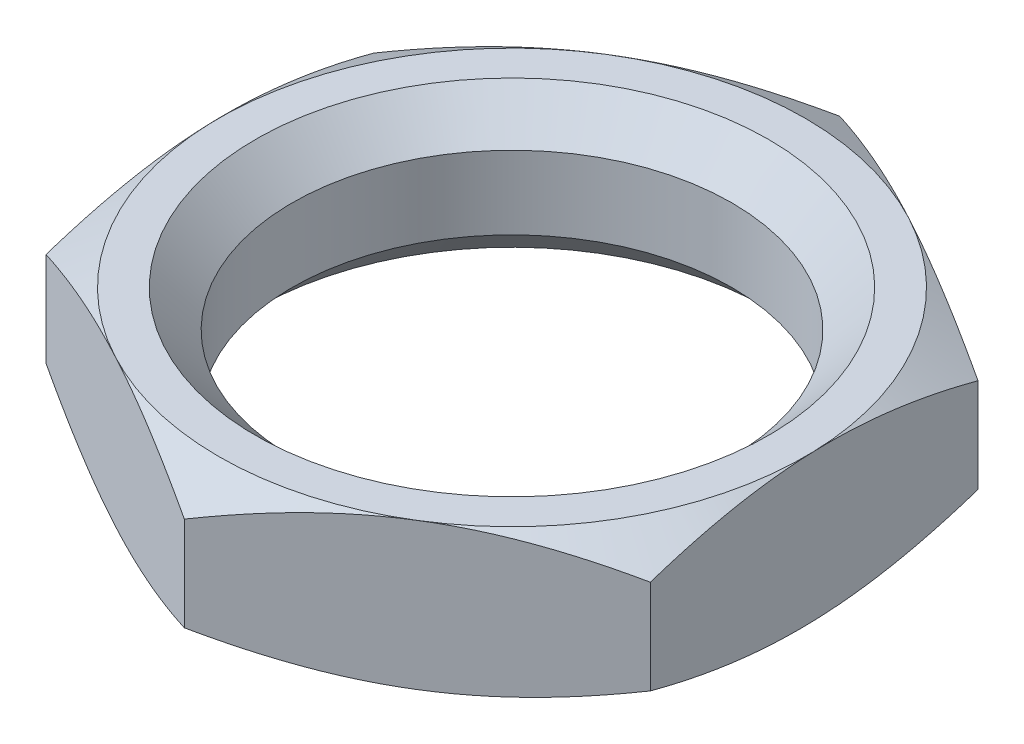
ISO-10303-21;
HEADER;
FILE_DESCRIPTION(('STEP AP214'),'2;1');
FILE_NAME('part.step','',(''),(''),'','','');
FILE_SCHEMA(('AUTOMOTIVE_DESIGN { 1 0 10303 214 1 1 1 1 }'));
ENDSEC;
DATA;
#1=APPLICATION_CONTEXT('core data for automotive mechanical design processes');
#2=APPLICATION_PROTOCOL_DEFINITION('international standard','automotive_design',2000,#1);
#3=PRODUCT_CONTEXT('',#1,'mechanical');
#4=PRODUCT('Part','Part','',(#3));
#5=PRODUCT_RELATED_PRODUCT_CATEGORY('part','',(#4));
#6=PRODUCT_DEFINITION_FORMATION('','',#4);
#7=PRODUCT_DEFINITION_CONTEXT('part definition',#1,'design');
#8=PRODUCT_DEFINITION('design','',#6,#7);
#9=PRODUCT_DEFINITION_SHAPE('','',#8);
#10=(LENGTH_UNIT() NAMED_UNIT(*) SI_UNIT(.MILLI.,.METRE.));
#11=(NAMED_UNIT(*) PLANE_ANGLE_UNIT() SI_UNIT($,.RADIAN.));
#12=(NAMED_UNIT(*) SI_UNIT($,.STERADIAN.) SOLID_ANGLE_UNIT());
#13=UNCERTAINTY_MEASURE_WITH_UNIT(LENGTH_MEASURE(1.E-05),#10,'distance_accuracy_value','');
#14=(GEOMETRIC_REPRESENTATION_CONTEXT(3) GLOBAL_UNCERTAINTY_ASSIGNED_CONTEXT((#13)) GLOBAL_UNIT_ASSIGNED_CONTEXT((#10,
#11,#12)) REPRESENTATION_CONTEXT('',''));
#15=CARTESIAN_POINT('',(0.,0.,0.));
#16=DIRECTION('',(0.,0.,1.));
#17=DIRECTION('',(1.,0.,0.));
#18=AXIS2_PLACEMENT_3D('',#15,#16,#17);
#19=CARTESIAN_POINT('',(8.14104973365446,4.,4.36539145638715));
#20=DIRECTION('',(-0.999507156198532,0.,0.0313917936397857));
#21=DIRECTION('',(0.0313917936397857,0.,0.999507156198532));
#22=AXIS2_PLACEMENT_3D('',#19,#20,#21);
#23=PLANE('',#22);
#24=CARTESIAN_POINT('',(7.85105848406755,0.714588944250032,-4.86786015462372));
#25=CARTESIAN_POINT('',(7.85743266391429,0.655982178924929,-4.66490780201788));
#26=CARTESIAN_POINT('',(7.86383060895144,0.600035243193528,-4.46119877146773));
#27=CARTESIAN_POINT('',(7.8766784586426,0.494193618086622,-4.05212632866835));
#28=CARTESIAN_POINT('',(7.88312838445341,0.444301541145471,-3.846762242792));
#29=CARTESIAN_POINT('',(7.90258143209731,0.304687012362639,-3.22738188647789));
#30=CARTESIAN_POINT('',(7.91566134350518,0.225276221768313,-2.81092065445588));
#31=CARTESIAN_POINT('',(7.93523517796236,0.132157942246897,-2.1876944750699));
#32=CARTESIAN_POINT('',(7.94167062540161,0.105631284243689,-1.98279137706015));
#33=CARTESIAN_POINT('',(7.95457062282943,0.0611506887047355,-1.57205856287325));
#34=CARTESIAN_POINT('',(7.96103517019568,0.0431959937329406,-1.36622893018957));
#35=CARTESIAN_POINT('',(7.97397539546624,0.01631435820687,-0.954215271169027));
#36=CARTESIAN_POINT('',(7.98045105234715,0.00737717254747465,-0.748031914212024));
#37=CARTESIAN_POINT('',(7.99340834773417,-0.00127784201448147,-0.335474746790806));
#38=CARTESIAN_POINT('',(7.99988998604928,-0.00099595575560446,-0.129100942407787));
#39=CARTESIAN_POINT('',(8.01200758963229,0.00814585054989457,0.256720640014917));
#40=CARTESIAN_POINT('',(8.01764441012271,0.0158905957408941,0.436195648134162));
#41=CARTESIAN_POINT('',(8.02890484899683,0.0382022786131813,0.794725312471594));
#42=CARTESIAN_POINT('',(8.03452846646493,0.0527696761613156,0.973779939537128));
#43=CARTESIAN_POINT('',(8.05137754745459,0.106361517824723,1.51025062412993));
#44=CARTESIAN_POINT('',(8.06257318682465,0.155268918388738,1.86671708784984));
#45=CARTESIAN_POINT('',(8.08508322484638,0.277537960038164,2.58343128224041));
#46=CARTESIAN_POINT('',(8.09639475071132,0.351417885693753,2.94358754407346));
#47=CARTESIAN_POINT('',(8.11884912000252,0.519094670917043,3.65852925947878));
#48=CARTESIAN_POINT('',(8.12999225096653,0.612852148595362,4.01332386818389));
#49=CARTESIAN_POINT('',(8.14105601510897,0.71458894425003,4.36559145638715));
#50=B_SPLINE_CURVE_WITH_KNOTS('',3,(#24,#25,#26,#27,#28,#29,#30,#31,#32,#33,#34,#35,#36,#37,#38,
#39,#40,#41,#42,#43,#44,#45,#46,#47,#48,#49),.UNSPECIFIED.,.F.,.F.,(4,2,2,2,2,2,2,2,2,2,2,2,4),
(0.,0.633972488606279,1.26821754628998,2.53934284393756,3.15933820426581,3.77927877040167,
4.39851420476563,5.01773050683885,5.55678748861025,6.09588080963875,7.17483533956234,
8.27771864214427,9.37843697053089),.UNSPECIFIED.);
#51=CARTESIAN_POINT('',(7.85106476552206,0.714531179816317,-4.86766015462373));
#52=VERTEX_POINT('',#51);
#53=CARTESIAN_POINT('',(7.99605724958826,0.,-0.251134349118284));
#54=VERTEX_POINT('',#53);
#55=EDGE_CURVE('E9261',#52,#54,#50,.T.);
#56=ORIENTED_EDGE('',*,*,#55,.F.);
#57=DIRECTION('',(0.,-1.,0.));
#58=VECTOR('',#57,1.);
#59=CARTESIAN_POINT('',(7.85106476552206,4.,-4.86766015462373));
#60=LINE('',#59,#58);
#61=CARTESIAN_POINT('',(7.85106476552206,3.28546882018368,-4.86766015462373));
#62=VERTEX_POINT('',#61);
#63=EDGE_CURVE('E9377',#62,#52,#60,.T.);
#64=ORIENTED_EDGE('',*,*,#63,.F.);
#65=CARTESIAN_POINT('',(8.14105601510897,3.28541105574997,4.36559145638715));
#66=CARTESIAN_POINT('',(8.13468183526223,3.34401782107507,4.1626391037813));
#67=CARTESIAN_POINT('',(8.12828389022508,3.39996475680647,3.95893007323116));
#68=CARTESIAN_POINT('',(8.11543604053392,3.50580638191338,3.54985763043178));
#69=CARTESIAN_POINT('',(8.10898611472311,3.55569845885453,3.34449354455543));
#70=CARTESIAN_POINT('',(8.08953306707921,3.69531298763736,2.72511318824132));
#71=CARTESIAN_POINT('',(8.07645315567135,3.77472377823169,2.30865195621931));
#72=CARTESIAN_POINT('',(8.05687932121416,3.8678420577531,1.68542577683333));
#73=CARTESIAN_POINT('',(8.05044387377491,3.89436871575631,1.48052267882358));
#74=CARTESIAN_POINT('',(8.0375438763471,3.93884931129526,1.06978986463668));
#75=CARTESIAN_POINT('',(8.03107932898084,3.95680400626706,0.863960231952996));
#76=CARTESIAN_POINT('',(8.01813910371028,3.98368564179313,0.451946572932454));
#77=CARTESIAN_POINT('',(8.01166344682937,3.99262282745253,0.245763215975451));
#78=CARTESIAN_POINT('',(7.99870615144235,4.00127784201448,-0.166793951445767));
#79=CARTESIAN_POINT('',(7.99222451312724,4.0009959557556,-0.373167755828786));
#80=CARTESIAN_POINT('',(7.98010690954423,3.99185414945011,-0.75898933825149));
#81=CARTESIAN_POINT('',(7.97447008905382,3.98410940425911,-0.938464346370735));
#82=CARTESIAN_POINT('',(7.96320965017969,3.96179772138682,-1.29699401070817));
#83=CARTESIAN_POINT('',(7.95758603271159,3.94723032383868,-1.4760486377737));
#84=CARTESIAN_POINT('',(7.94073695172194,3.89363848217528,-2.01251932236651));
#85=CARTESIAN_POINT('',(7.92954131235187,3.84473108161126,-2.36898578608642));
#86=CARTESIAN_POINT('',(7.90703127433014,3.72246203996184,-3.08569998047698));
#87=CARTESIAN_POINT('',(7.8957197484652,3.64858211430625,-3.44585624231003));
#88=CARTESIAN_POINT('',(7.873265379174,3.48090532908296,-4.16079795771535));
#89=CARTESIAN_POINT('',(7.86212224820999,3.38714785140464,-4.51559256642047));
#90=CARTESIAN_POINT('',(7.85105848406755,3.28541105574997,-4.86786015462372));
#91=B_SPLINE_CURVE_WITH_KNOTS('',3,(#65,#66,#67,#68,#69,#70,#71,#72,#73,#74,#75,#76,#77,#78,#79,
#80,#81,#82,#83,#84,#85,#86,#87,#88,#89,#90),.UNSPECIFIED.,.F.,.F.,(4,2,2,2,2,2,2,2,2,2,2,2,4),
(0.,0.633972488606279,1.26821754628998,2.53934284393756,3.15933820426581,3.77927877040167,
4.39851420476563,5.01773050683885,5.55678748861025,6.09588080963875,7.17483533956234,
8.27771864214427,9.37843697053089),.UNSPECIFIED.);
#92=CARTESIAN_POINT('',(7.99605724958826,4.,-0.251134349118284));
#93=VERTEX_POINT('',#92);
#94=EDGE_CURVE('E9358',#93,#62,#91,.T.);
#95=ORIENTED_EDGE('',*,*,#94,.F.);
#96=CARTESIAN_POINT('',(8.14104973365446,3.28546882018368,4.36539145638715));
#97=VERTEX_POINT('',#96);
#98=EDGE_CURVE('E9363',#97,#93,#91,.T.);
#99=ORIENTED_EDGE('',*,*,#98,.F.);
#100=DIRECTION('',(0.,-1.,0.));
#101=VECTOR('',#100,1.);
#102=CARTESIAN_POINT('',(8.14104973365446,4.,4.36539145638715));
#103=LINE('',#102,#101);
#104=CARTESIAN_POINT('',(8.14104973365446,0.714531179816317,4.36539145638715));
#105=VERTEX_POINT('',#104);
#106=EDGE_CURVE('E9287',#97,#105,#103,.T.);
#107=ORIENTED_EDGE('',*,*,#106,.T.);
#108=EDGE_CURVE('E9270',#54,#105,#50,.T.);
#109=ORIENTED_EDGE('',*,*,#108,.F.);
#110=EDGE_LOOP('',(#56,#64,#95,#99,#107,#109));
#111=FACE_BOUND('',#110,.T.);
#112=ADVANCED_FACE('F9174',(#111),#23,.F.);
#113=CARTESIAN_POINT('',(7.85106476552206,4.,-4.86766015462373));
#114=DIRECTION('',(-0.472567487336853,0.,0.881294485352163));
#115=DIRECTION('',(0.881294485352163,0.,0.472567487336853));
#116=AXIS2_PLACEMENT_3D('',#113,#114,#115);
#117=PLANE('',#116);
#118=CARTESIAN_POINT('',(-0.290184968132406,0.714596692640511,-9.23315885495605));
#119=CARTESIAN_POINT('',(-0.111235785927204,0.655989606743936,-9.13720277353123));
#120=CARTESIAN_POINT('',(0.0683805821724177,0.600042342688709,-9.04088893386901));
#121=CARTESIAN_POINT('',(0.429072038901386,0.494200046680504,-8.84747905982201));
#122=CARTESIAN_POINT('',(0.610147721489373,0.444307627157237,-8.75038270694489));
#123=CARTESIAN_POINT('',(1.15627400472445,0.304692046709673,-8.45753902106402));
#124=CARTESIAN_POINT('',(1.52348040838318,0.225280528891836,-8.26063570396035));
#125=CARTESIAN_POINT('',(2.07299769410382,0.132161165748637,-7.96597369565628));
#126=CARTESIAN_POINT('',(2.2536669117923,0.105634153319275,-7.86909529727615));
#127=CARTESIAN_POINT('',(2.61582238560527,0.0611528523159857,-7.67490038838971));
#128=CARTESIAN_POINT('',(2.79730856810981,0.0431978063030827,-7.57758391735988));
#129=CARTESIAN_POINT('',(3.16059342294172,0.0163154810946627,-7.38278341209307));
#130=CARTESIAN_POINT('',(3.34239150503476,0.00737795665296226,-7.28529969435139));
#131=CARTESIAN_POINT('',(3.70615561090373,-0.00127771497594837,-7.09024220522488));
#132=CARTESIAN_POINT('',(3.88812162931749,-0.000996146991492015,-6.99266843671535));
#133=CARTESIAN_POINT('',(4.22831372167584,0.00814513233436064,-6.81025072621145));
#134=CARTESIAN_POINT('',(4.38656380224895,0.0158897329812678,-6.72539391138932));
#135=CARTESIAN_POINT('',(4.70269332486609,0.0382012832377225,-6.55587902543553));
#136=CARTESIAN_POINT('',(4.86057274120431,0.0527686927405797,-6.47122096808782));
#137=CARTESIAN_POINT('',(5.33359977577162,0.106360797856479,-6.2175745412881));
#138=CARTESIAN_POINT('',(5.64791009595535,0.155268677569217,-6.04903514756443));
#139=CARTESIAN_POINT('',(6.27986488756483,0.277539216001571,-5.71016852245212));
#140=CARTESIAN_POINT('',(6.59742870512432,0.351420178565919,-5.53988453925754));
#141=CARTESIAN_POINT('',(7.22782062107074,0.519099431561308,-5.20185595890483));
#142=CARTESIAN_POINT('',(7.54065679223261,0.612858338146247,-5.03410703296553));
#143=CARTESIAN_POINT('',(7.85126476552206,0.714596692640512,-4.86755291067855));
#144=B_SPLINE_CURVE_WITH_KNOTS('',3,(#118,#119,#120,#121,#122,#123,#124,#125,#126,#127,#128,
#129,#130,#131,#132,#133,#134,#135,#136,#137,#138,#139,#140,#141,#142,#143),.UNSPECIFIED.,.F.,
.F.,(4,2,2,2,2,2,2,2,2,2,2,2,4),(0.,0.633973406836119,1.26821938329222,2.53934656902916,
3.15934276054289,3.77928415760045,4.39852041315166,5.01773753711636,5.55680046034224,
6.09589972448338,7.17486617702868,8.27776203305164,9.37849282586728),.UNSPECIFIED.);
#145=CARTESIAN_POINT('',(-0.289984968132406,0.714531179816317,-9.23305161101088));
#146=VERTEX_POINT('',#145);
#147=CARTESIAN_POINT('',(3.78053989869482,0.,-7.0503558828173));
#148=VERTEX_POINT('',#147);
#149=EDGE_CURVE('E9330',#146,#148,#144,.T.);
#150=ORIENTED_EDGE('',*,*,#149,.F.);
#151=DIRECTION('',(0.,-1.,0.));
#152=VECTOR('',#151,1.);
#153=CARTESIAN_POINT('',(-0.289984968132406,4.,-9.23305161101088));
#154=LINE('',#153,#152);
#155=CARTESIAN_POINT('',(-0.289984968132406,3.28546882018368,-9.23305161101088));
#156=VERTEX_POINT('',#155);
#157=EDGE_CURVE('E9374',#156,#146,#154,.T.);
#158=ORIENTED_EDGE('',*,*,#157,.F.);
#159=CARTESIAN_POINT('',(7.85126476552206,3.28540330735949,-4.86755291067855));
#160=CARTESIAN_POINT('',(7.67231558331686,3.34401039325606,-4.96350899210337));
#161=CARTESIAN_POINT('',(7.49269921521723,3.39995765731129,-5.0598228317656));
#162=CARTESIAN_POINT('',(7.13200775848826,3.50579995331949,-5.2532327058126));
#163=CARTESIAN_POINT('',(6.95093207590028,3.55569237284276,-5.35032905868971));
#164=CARTESIAN_POINT('',(6.4048057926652,3.69530795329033,-5.64317274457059));
#165=CARTESIAN_POINT('',(6.03759938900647,3.77471947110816,-5.84007606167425));
#166=CARTESIAN_POINT('',(5.48808210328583,3.86783883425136,-6.13473806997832));
#167=CARTESIAN_POINT('',(5.30741288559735,3.89436584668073,-6.23161646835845));
#168=CARTESIAN_POINT('',(4.94525741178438,3.93884714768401,-6.42581137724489));
#169=CARTESIAN_POINT('',(4.76377122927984,3.95680219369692,-6.52312784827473));
#170=CARTESIAN_POINT('',(4.40048637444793,3.98368451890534,-6.71792835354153));
#171=CARTESIAN_POINT('',(4.21868829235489,3.99262204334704,-6.81541207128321));
#172=CARTESIAN_POINT('',(3.85492418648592,4.00127771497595,-7.01046956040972));
#173=CARTESIAN_POINT('',(3.67295816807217,4.00099614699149,-7.10804332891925));
#174=CARTESIAN_POINT('',(3.33276607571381,3.99185486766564,-7.29046103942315));
#175=CARTESIAN_POINT('',(3.1745159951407,3.98411026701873,-7.37531785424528));
#176=CARTESIAN_POINT('',(2.85838647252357,3.96179871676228,-7.54483274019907));
#177=CARTESIAN_POINT('',(2.70050705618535,3.94723130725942,-7.62949079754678));
#178=CARTESIAN_POINT('',(2.22748002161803,3.89363920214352,-7.88313722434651));
#179=CARTESIAN_POINT('',(1.9131697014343,3.84473132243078,-8.05167661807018));
#180=CARTESIAN_POINT('',(1.28121490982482,3.72246078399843,-8.39054324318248));
#181=CARTESIAN_POINT('',(0.963651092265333,3.64857982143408,-8.56082722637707));
#182=CARTESIAN_POINT('',(0.333259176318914,3.48090056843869,-8.89885580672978));
#183=CARTESIAN_POINT('',(0.0204230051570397,3.38714166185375,-9.06660473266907));
#184=CARTESIAN_POINT('',(-0.290184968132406,3.28540330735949,-9.23315885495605));
#185=B_SPLINE_CURVE_WITH_KNOTS('',3,(#159,#160,#161,#162,#163,#164,#165,#166,#167,#168,#169,
#170,#171,#172,#173,#174,#175,#176,#177,#178,#179,#180,#181,#182,#183,#184),.UNSPECIFIED.,.F.,
.F.,(4,2,2,2,2,2,2,2,2,2,2,2,4),(0.,0.633973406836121,1.26821938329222,2.53934656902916,
3.15934276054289,3.77928415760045,4.39852041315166,5.01773753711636,5.55680046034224,
6.09589972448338,7.17486617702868,8.27776203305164,9.37849282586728),.UNSPECIFIED.);
#186=CARTESIAN_POINT('',(3.78053989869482,4.,-7.0503558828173));
#187=VERTEX_POINT('',#186);
#188=EDGE_CURVE('E9345',#187,#156,#185,.T.);
#189=ORIENTED_EDGE('',*,*,#188,.F.);
#190=EDGE_CURVE('E9351',#62,#187,#185,.T.);
#191=ORIENTED_EDGE('',*,*,#190,.F.);
#192=ORIENTED_EDGE('',*,*,#63,.T.);
#193=EDGE_CURVE('E9264',#148,#52,#144,.T.);
#194=ORIENTED_EDGE('',*,*,#193,.F.);
#195=EDGE_LOOP('',(#150,#158,#189,#191,#192,#194));
#196=FACE_BOUND('',#195,.T.);
#197=ADVANCED_FACE('F9337',(#196),#117,.F.);
#198=CARTESIAN_POINT('',(-0.289984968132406,4.,-9.23305161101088));
#199=DIRECTION('',(0.52693966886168,0.,0.849902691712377));
#200=DIRECTION('',(0.849902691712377,0.,-0.52693966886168));
#201=AXIS2_PLACEMENT_3D('',#198,#199,#200);
#202=PLANE('',#201);
#203=CARTESIAN_POINT('',(-8.14124973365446,0.714599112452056,-4.36526745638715));
#204=CARTESIAN_POINT('',(-7.96867467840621,0.655991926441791,-4.47226399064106));
#205=CARTESIAN_POINT('',(-7.79545620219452,0.600044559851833,-4.57965944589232));
#206=CARTESIAN_POINT('',(-7.44761248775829,0.494202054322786,-4.79532254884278));
#207=CARTESIAN_POINT('',(-7.27298667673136,0.444309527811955,-4.90359055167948));
#208=CARTESIAN_POINT('',(-6.74631327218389,0.304693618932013,-5.23012806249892));
#209=CARTESIAN_POINT('',(-6.39218666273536,0.225281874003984,-5.44968656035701));
#210=CARTESIAN_POINT('',(-5.86224303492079,0.132162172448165,-5.77825160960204));
#211=CARTESIAN_POINT('',(-5.68800921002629,0.105635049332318,-5.88627658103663));
#212=CARTESIAN_POINT('',(-5.33875362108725,0.0611535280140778,-6.10281504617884));
#213=CARTESIAN_POINT('',(-5.16373192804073,0.043198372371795,-6.21132849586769));
#214=CARTESIAN_POINT('',(-4.81338717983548,0.0163158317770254,-6.42854223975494));
#215=CARTESIAN_POINT('',(-4.63806469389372,0.00737820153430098,-6.53724218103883));
#216=CARTESIAN_POINT('',(-4.28725775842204,-0.00127767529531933,-6.75474248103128));
#217=CARTESIAN_POINT('',(-4.11177331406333,-0.000996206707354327,-6.86354283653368));
#218=CARTESIAN_POINT('',(-3.78369829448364,0.00814490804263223,-7.06694934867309));
#219=CARTESIAN_POINT('',(-3.63108456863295,0.0158894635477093,-7.16156985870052));
#220=CARTESIAN_POINT('',(-3.32621455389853,0.0382009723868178,-7.35058926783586));
#221=CARTESIAN_POINT('',(-3.17395828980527,0.0527683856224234,-7.44498815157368));
#222=CARTESIAN_POINT('',(-2.71777894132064,0.106360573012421,-7.72781934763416));
#223=CARTESIAN_POINT('',(-2.41466333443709,0.155268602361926,-7.91575102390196));
#224=CARTESIAN_POINT('',(-1.80521670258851,0.277539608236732,-8.29360793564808));
#225=CARTESIAN_POINT('',(-1.49896345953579,0.351420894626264,-8.48348494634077));
#226=CARTESIAN_POINT('',(-0.891024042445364,0.51910091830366,-8.86040738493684));
#227=CARTESIAN_POINT('',(-0.589330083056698,0.612860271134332,-9.04745763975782));
#228=CARTESIAN_POINT('',(-0.289784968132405,0.714599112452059,-9.23317561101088));
#229=B_SPLINE_CURVE_WITH_KNOTS('',3,(#203,#204,#205,#206,#207,#208,#209,#210,#211,#212,#213,
#214,#215,#216,#217,#218,#219,#220,#221,#222,#223,#224,#225,#226,#227,#228),.UNSPECIFIED.,.F.,
.F.,(4,2,2,2,2,2,2,2,2,2,2,2,4),(0.,0.633973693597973,1.26821995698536,2.53934773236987,
3.15934418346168,3.77928584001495,4.39852235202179,5.01773973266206,5.55680451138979,
6.09590563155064,7.17487580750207,8.27777558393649,9.37851026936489),.UNSPECIFIED.);
#230=CARTESIAN_POINT('',(-8.14104973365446,0.714531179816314,-4.36539145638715));
#231=VERTEX_POINT('',#230);
#232=CARTESIAN_POINT('',(-4.21551735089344,0.,-6.79922153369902));
#233=VERTEX_POINT('',#232);
#234=EDGE_CURVE('E9459',#231,#233,#229,.T.);
#235=ORIENTED_EDGE('',*,*,#234,.F.);
#236=DIRECTION('',(0.,-1.,0.));
#237=VECTOR('',#236,1.);
#238=CARTESIAN_POINT('',(-8.14104973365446,4.,-4.36539145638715));
#239=LINE('',#238,#237);
#240=CARTESIAN_POINT('',(-8.14104973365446,3.28546882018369,-4.36539145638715));
#241=VERTEX_POINT('',#240);
#242=EDGE_CURVE('E9371',#241,#231,#239,.T.);
#243=ORIENTED_EDGE('',*,*,#242,.F.);
#244=CARTESIAN_POINT('',(-0.289784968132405,3.28540088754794,-9.23317561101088));
#245=CARTESIAN_POINT('',(-0.462360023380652,3.34400807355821,-9.12617907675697));
#246=CARTESIAN_POINT('',(-0.635578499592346,3.39995544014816,-9.01878362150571));
#247=CARTESIAN_POINT('',(-0.983422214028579,3.50579794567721,-8.80312051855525));
#248=CARTESIAN_POINT('',(-1.15804802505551,3.55569047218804,-8.69485251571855));
#249=CARTESIAN_POINT('',(-1.68472142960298,3.69530638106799,-8.36831500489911));
#250=CARTESIAN_POINT('',(-2.03884803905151,3.77471812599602,-8.14875650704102));
#251=CARTESIAN_POINT('',(-2.56879166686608,3.86783782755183,-7.82019145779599));
#252=CARTESIAN_POINT('',(-2.74302549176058,3.89436495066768,-7.7121664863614));
#253=CARTESIAN_POINT('',(-3.09228108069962,3.93884647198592,-7.49562802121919));
#254=CARTESIAN_POINT('',(-3.26730277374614,3.9568016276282,-7.38711457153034));
#255=CARTESIAN_POINT('',(-3.61764752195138,3.98368416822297,-7.16990082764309));
#256=CARTESIAN_POINT('',(-3.79297000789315,3.9926217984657,-7.0612008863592));
#257=CARTESIAN_POINT('',(-4.14377694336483,4.00127767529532,-6.84370058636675));
#258=CARTESIAN_POINT('',(-4.31926138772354,4.00099620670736,-6.73490023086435));
#259=CARTESIAN_POINT('',(-4.64733640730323,3.99185509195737,-6.53149371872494));
#260=CARTESIAN_POINT('',(-4.79995013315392,3.98411053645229,-6.43687320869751));
#261=CARTESIAN_POINT('',(-5.10482014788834,3.96179902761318,-6.24785379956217));
#262=CARTESIAN_POINT('',(-5.25707641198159,3.94723161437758,-6.15345491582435));
#263=CARTESIAN_POINT('',(-5.71325576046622,3.89363942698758,-5.87062371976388));
#264=CARTESIAN_POINT('',(-6.01637136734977,3.84473139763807,-5.68269204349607));
#265=CARTESIAN_POINT('',(-6.62581799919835,3.72246039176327,-5.30483513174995));
#266=CARTESIAN_POINT('',(-6.93207124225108,3.64857910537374,-5.11495812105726));
#267=CARTESIAN_POINT('',(-7.5400106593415,3.48089908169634,-4.73803568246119));
#268=CARTESIAN_POINT('',(-7.84170461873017,3.38713972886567,-4.55098542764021));
#269=CARTESIAN_POINT('',(-8.14124973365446,3.28540088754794,-4.36526745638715));
#270=B_SPLINE_CURVE_WITH_KNOTS('',3,(#244,#245,#246,#247,#248,#249,#250,#251,#252,#253,#254,
#255,#256,#257,#258,#259,#260,#261,#262,#263,#264,#265,#266,#267,#268,#269),.UNSPECIFIED.,.F.,
.F.,(4,2,2,2,2,2,2,2,2,2,2,2,4),(0.,0.633973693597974,1.26821995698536,2.53934773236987,
3.15934418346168,3.77928584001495,4.39852235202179,5.01773973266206,5.55680451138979,
6.09590563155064,7.17487580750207,8.27777558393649,9.37851026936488),.UNSPECIFIED.);
#271=CARTESIAN_POINT('',(-4.21551735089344,4.,-6.79922153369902));
#272=VERTEX_POINT('',#271);
#273=EDGE_CURVE('E9353',#272,#241,#270,.T.);
#274=ORIENTED_EDGE('',*,*,#273,.F.);
#275=EDGE_CURVE('E9352',#156,#272,#270,.T.);
#276=ORIENTED_EDGE('',*,*,#275,.F.);
#277=ORIENTED_EDGE('',*,*,#157,.T.);
#278=EDGE_CURVE('E9331',#233,#146,#229,.T.);
#279=ORIENTED_EDGE('',*,*,#278,.F.);
#280=EDGE_LOOP('',(#235,#243,#274,#276,#277,#279));
#281=FACE_BOUND('',#280,.T.);
#282=ADVANCED_FACE('F9340',(#281),#202,.F.);
#283=CARTESIAN_POINT('',(-8.14104973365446,4.,-4.36539145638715));
#284=DIRECTION('',(0.999507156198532,0.,-0.0313917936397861));
#285=DIRECTION('',(-0.0313917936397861,0.,-0.999507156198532));
#286=AXIS2_PLACEMENT_3D('',#283,#284,#285);
#287=PLANE('',#286);
#288=CARTESIAN_POINT('',(-7.85105848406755,0.714588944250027,4.86786015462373));
#289=CARTESIAN_POINT('',(-7.85743266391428,0.655982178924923,4.66490780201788));
#290=CARTESIAN_POINT('',(-7.86383060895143,0.600035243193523,4.46119877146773));
#291=CARTESIAN_POINT('',(-7.87667845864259,0.494193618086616,4.05212632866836));
#292=CARTESIAN_POINT('',(-7.8831283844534,0.444301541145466,3.84676224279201));
#293=CARTESIAN_POINT('',(-7.9025814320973,0.304687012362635,3.22738188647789));
#294=CARTESIAN_POINT('',(-7.91566134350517,0.225276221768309,2.81092065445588));
#295=CARTESIAN_POINT('',(-7.93523517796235,0.132157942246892,2.18769447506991));
#296=CARTESIAN_POINT('',(-7.94167062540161,0.105631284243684,1.98279137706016));
#297=CARTESIAN_POINT('',(-7.95457062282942,0.0611506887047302,1.57205856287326));
#298=CARTESIAN_POINT('',(-7.96103517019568,0.0431959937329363,1.36622893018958));
#299=CARTESIAN_POINT('',(-7.97397539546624,0.0163143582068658,0.954215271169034));
#300=CARTESIAN_POINT('',(-7.98045105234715,0.00737717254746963,0.748031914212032));
#301=CARTESIAN_POINT('',(-7.99340834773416,-0.00127784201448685,0.335474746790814));
#302=CARTESIAN_POINT('',(-7.99988998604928,-0.000995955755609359,0.129100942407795));
#303=CARTESIAN_POINT('',(-8.01200758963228,0.00814585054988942,-0.25672064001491));
#304=CARTESIAN_POINT('',(-8.0176444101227,0.0158905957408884,-0.436195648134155));
#305=CARTESIAN_POINT('',(-8.02890484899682,0.0382022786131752,-0.794725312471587));
#306=CARTESIAN_POINT('',(-8.03452846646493,0.0527696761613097,-0.973779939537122));
#307=CARTESIAN_POINT('',(-8.05137754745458,0.106361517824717,-1.51025062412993));
#308=CARTESIAN_POINT('',(-8.06257318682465,0.155268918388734,-1.86671708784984));
#309=CARTESIAN_POINT('',(-8.08508322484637,0.27753796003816,-2.5834312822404));
#310=CARTESIAN_POINT('',(-8.09639475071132,0.351417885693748,-2.94358754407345));
#311=CARTESIAN_POINT('',(-8.11884912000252,0.519094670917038,-3.65852925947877));
#312=CARTESIAN_POINT('',(-8.12999225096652,0.612852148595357,-4.01332386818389));
#313=CARTESIAN_POINT('',(-8.14105601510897,0.714588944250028,-4.36559145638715));
#314=B_SPLINE_CURVE_WITH_KNOTS('',3,(#288,#289,#290,#291,#292,#293,#294,#295,#296,#297,#298,
#299,#300,#301,#302,#303,#304,#305,#306,#307,#308,#309,#310,#311,#312,#313),.UNSPECIFIED.,.F.,
.F.,(4,2,2,2,2,2,2,2,2,2,2,2,4),(0.,0.633972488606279,1.26821754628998,2.53934284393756,
3.15933820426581,3.77927877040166,4.39851420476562,5.01773050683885,5.55678748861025,
6.09588080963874,7.17483533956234,8.27771864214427,9.37843697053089),.UNSPECIFIED.);
#315=CARTESIAN_POINT('',(-7.85106476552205,0.714531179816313,4.86766015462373));
#316=VERTEX_POINT('',#315);
#317=CARTESIAN_POINT('',(-7.99605724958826,0.,0.251134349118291));
#318=VERTEX_POINT('',#317);
#319=EDGE_CURVE('E9300',#316,#318,#314,.T.);
#320=ORIENTED_EDGE('',*,*,#319,.F.);
#321=DIRECTION('',(0.,-1.,0.));
#322=VECTOR('',#321,1.);
#323=CARTESIAN_POINT('',(-7.85106476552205,4.,4.86766015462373));
#324=LINE('',#323,#322);
#325=CARTESIAN_POINT('',(-7.85106476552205,3.28546882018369,4.86766015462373));
#326=VERTEX_POINT('',#325);
#327=EDGE_CURVE('E9368',#326,#316,#324,.T.);
#328=ORIENTED_EDGE('',*,*,#327,.F.);
#329=CARTESIAN_POINT('',(-8.14105601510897,3.28541105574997,-4.36559145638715));
#330=CARTESIAN_POINT('',(-8.13468183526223,3.34401782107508,-4.1626391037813));
#331=CARTESIAN_POINT('',(-8.12828389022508,3.39996475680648,-3.95893007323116));
#332=CARTESIAN_POINT('',(-8.11543604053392,3.50580638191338,-3.54985763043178));
#333=CARTESIAN_POINT('',(-8.10898611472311,3.55569845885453,-3.34449354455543));
#334=CARTESIAN_POINT('',(-8.08953306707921,3.69531298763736,-2.72511318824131));
#335=CARTESIAN_POINT('',(-8.07645315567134,3.77472377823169,-2.3086519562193));
#336=CARTESIAN_POINT('',(-8.05687932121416,3.86784205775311,-1.68542577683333));
#337=CARTESIAN_POINT('',(-8.0504438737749,3.89436871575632,-1.48052267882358));
#338=CARTESIAN_POINT('',(-8.03754387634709,3.93884931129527,-1.06978986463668));
#339=CARTESIAN_POINT('',(-8.03107932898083,3.95680400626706,-0.863960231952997));
#340=CARTESIAN_POINT('',(-8.01813910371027,3.98368564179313,-0.451946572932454));
#341=CARTESIAN_POINT('',(-8.01166344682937,3.99262282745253,-0.245763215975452));
#342=CARTESIAN_POINT('',(-7.99870615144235,4.00127784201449,0.166793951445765));
#343=CARTESIAN_POINT('',(-7.99222451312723,4.00099595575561,0.373167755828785));
#344=CARTESIAN_POINT('',(-7.98010690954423,3.99185414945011,0.758989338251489));
#345=CARTESIAN_POINT('',(-7.97447008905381,3.98410940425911,0.938464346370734));
#346=CARTESIAN_POINT('',(-7.96320965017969,3.96179772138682,1.29699401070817));
#347=CARTESIAN_POINT('',(-7.95758603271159,3.94723032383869,1.4760486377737));
#348=CARTESIAN_POINT('',(-7.94073695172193,3.89363848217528,2.01251932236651));
#349=CARTESIAN_POINT('',(-7.92954131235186,3.84473108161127,2.36898578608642));
#350=CARTESIAN_POINT('',(-7.90703127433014,3.72246203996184,3.08569998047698));
#351=CARTESIAN_POINT('',(-7.89571974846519,3.64858211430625,3.44585624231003));
#352=CARTESIAN_POINT('',(-7.87326537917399,3.48090532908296,4.16079795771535));
#353=CARTESIAN_POINT('',(-7.86212224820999,3.38714785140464,4.51559256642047));
#354=CARTESIAN_POINT('',(-7.85105848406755,3.28541105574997,4.86786015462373));
#355=B_SPLINE_CURVE_WITH_KNOTS('',3,(#329,#330,#331,#332,#333,#334,#335,#336,#337,#338,#339,
#340,#341,#342,#343,#344,#345,#346,#347,#348,#349,#350,#351,#352,#353,#354),.UNSPECIFIED.,.F.,
.F.,(4,2,2,2,2,2,2,2,2,2,2,2,4),(0.,0.633972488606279,1.26821754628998,2.53934284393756,
3.15933820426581,3.77927877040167,4.39851420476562,5.01773050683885,5.55678748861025,
6.09588080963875,7.17483533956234,8.27771864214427,9.37843697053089),.UNSPECIFIED.);
#356=CARTESIAN_POINT('',(-7.99605724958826,4.,0.251134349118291));
#357=VERTEX_POINT('',#356);
#358=EDGE_CURVE('E9413',#357,#326,#355,.T.);
#359=ORIENTED_EDGE('',*,*,#358,.F.);
#360=EDGE_CURVE('E9426',#241,#357,#355,.T.);
#361=ORIENTED_EDGE('',*,*,#360,.F.);
#362=ORIENTED_EDGE('',*,*,#242,.T.);
#363=EDGE_CURVE('E9463',#318,#231,#314,.T.);
#364=ORIENTED_EDGE('',*,*,#363,.F.);
#365=EDGE_LOOP('',(#320,#328,#359,#361,#362,#364));
#366=FACE_BOUND('',#365,.T.);
#367=ADVANCED_FACE('F9425',(#366),#287,.F.);
#368=CARTESIAN_POINT('',(-7.85106476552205,4.,4.86766015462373));
#369=DIRECTION('',(0.472567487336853,0.,-0.881294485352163));
#370=DIRECTION('',(-0.881294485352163,0.,-0.472567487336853));
#371=AXIS2_PLACEMENT_3D('',#368,#369,#370);
#372=PLANE('',#371);
#373=CARTESIAN_POINT('',(0.290184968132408,0.714596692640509,9.23315885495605));
#374=CARTESIAN_POINT('',(0.111235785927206,0.655989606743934,9.13720277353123));
#375=CARTESIAN_POINT('',(-0.068380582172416,0.600042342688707,9.04088893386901));
#376=CARTESIAN_POINT('',(-0.429072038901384,0.494200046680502,8.84747905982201));
#377=CARTESIAN_POINT('',(-0.610147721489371,0.444307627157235,8.75038270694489));
#378=CARTESIAN_POINT('',(-1.15627400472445,0.30469204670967,8.45753902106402));
#379=CARTESIAN_POINT('',(-1.52348040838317,0.225280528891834,8.26063570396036));
#380=CARTESIAN_POINT('',(-2.07299769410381,0.132161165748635,7.96597369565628));
#381=CARTESIAN_POINT('',(-2.25366691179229,0.105634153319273,7.86909529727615));
#382=CARTESIAN_POINT('',(-2.61582238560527,0.0611528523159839,7.67490038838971));
#383=CARTESIAN_POINT('',(-2.79730856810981,0.0431978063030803,7.57758391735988));
#384=CARTESIAN_POINT('',(-3.16059342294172,0.0163154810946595,7.38278341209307));
#385=CARTESIAN_POINT('',(-3.34239150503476,0.00737795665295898,7.2852996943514));
#386=CARTESIAN_POINT('',(-3.70615561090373,-0.00127771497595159,7.09024220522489));
#387=CARTESIAN_POINT('',(-3.88812162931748,-0.000996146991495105,6.99266843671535));
#388=CARTESIAN_POINT('',(-4.22831372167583,0.00814513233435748,6.81025072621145));
#389=CARTESIAN_POINT('',(-4.38656380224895,0.0158897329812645,6.72539391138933));
#390=CARTESIAN_POINT('',(-4.70269332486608,0.0382012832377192,6.55587902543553));
#391=CARTESIAN_POINT('',(-4.8605727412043,0.0527686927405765,6.47122096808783));
#392=CARTESIAN_POINT('',(-5.33359977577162,0.106360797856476,6.2175745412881));
#393=CARTESIAN_POINT('',(-5.64791009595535,0.155268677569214,6.04903514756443));
#394=CARTESIAN_POINT('',(-6.27986488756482,0.277539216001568,5.71016852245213));
#395=CARTESIAN_POINT('',(-6.59742870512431,0.351420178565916,5.53988453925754));
#396=CARTESIAN_POINT('',(-7.22782062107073,0.519099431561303,5.20185595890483));
#397=CARTESIAN_POINT('',(-7.54065679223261,0.612858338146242,5.03410703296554));
#398=CARTESIAN_POINT('',(-7.85126476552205,0.714596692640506,4.86755291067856));
#399=B_SPLINE_CURVE_WITH_KNOTS('',3,(#373,#374,#375,#376,#377,#378,#379,#380,#381,#382,#383,
#384,#385,#386,#387,#388,#389,#390,#391,#392,#393,#394,#395,#396,#397,#398),.UNSPECIFIED.,.F.,
.F.,(4,2,2,2,2,2,2,2,2,2,2,2,4),(0.,0.63397340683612,1.26821938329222,2.53934656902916,
3.15934276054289,3.77928415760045,4.39852041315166,5.01773753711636,5.55680046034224,
6.09589972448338,7.17486617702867,8.27776203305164,9.37849282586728),.UNSPECIFIED.);
#400=CARTESIAN_POINT('',(0.289984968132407,0.714531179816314,9.23305161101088));
#401=VERTEX_POINT('',#400);
#402=CARTESIAN_POINT('',(-3.78053989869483,0.,7.05035588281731));
#403=VERTEX_POINT('',#402);
#404=EDGE_CURVE('E9288',#401,#403,#399,.T.);
#405=ORIENTED_EDGE('',*,*,#404,.F.);
#406=DIRECTION('',(0.,-1.,0.));
#407=VECTOR('',#406,1.);
#408=CARTESIAN_POINT('',(0.289984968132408,4.,9.23305161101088));
#409=LINE('',#408,#407);
#410=CARTESIAN_POINT('',(0.289984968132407,3.28546882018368,9.23305161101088));
#411=VERTEX_POINT('',#410);
#412=EDGE_CURVE('E9365',#411,#401,#409,.T.);
#413=ORIENTED_EDGE('',*,*,#412,.F.);
#414=CARTESIAN_POINT('',(-7.85126476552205,3.28540330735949,4.86755291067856));
#415=CARTESIAN_POINT('',(-7.67231558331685,3.34401039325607,4.96350899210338));
#416=CARTESIAN_POINT('',(-7.49269921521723,3.3999576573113,5.0598228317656));
#417=CARTESIAN_POINT('',(-7.13200775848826,3.5057999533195,5.2532327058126));
#418=CARTESIAN_POINT('',(-6.95093207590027,3.55569237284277,5.35032905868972));
#419=CARTESIAN_POINT('',(-6.40480579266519,3.69530795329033,5.64317274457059));
#420=CARTESIAN_POINT('',(-6.03759938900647,3.77471947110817,5.84007606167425));
#421=CARTESIAN_POINT('',(-5.48808210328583,3.86783883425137,6.13473806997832));
#422=CARTESIAN_POINT('',(-5.30741288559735,3.89436584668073,6.23161646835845));
#423=CARTESIAN_POINT('',(-4.94525741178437,3.93884714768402,6.4258113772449));
#424=CARTESIAN_POINT('',(-4.76377122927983,3.95680219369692,6.52312784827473));
#425=CARTESIAN_POINT('',(-4.40048637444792,3.98368451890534,6.71792835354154));
#426=CARTESIAN_POINT('',(-4.21868829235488,3.99262204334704,6.81541207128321));
#427=CARTESIAN_POINT('',(-3.85492418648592,4.00127771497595,7.01046956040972));
#428=CARTESIAN_POINT('',(-3.67295816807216,4.0009961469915,7.10804332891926));
#429=CARTESIAN_POINT('',(-3.33276607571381,3.99185486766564,7.29046103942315));
#430=CARTESIAN_POINT('',(-3.1745159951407,3.98411026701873,7.37531785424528));
#431=CARTESIAN_POINT('',(-2.85838647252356,3.96179871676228,7.54483274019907));
#432=CARTESIAN_POINT('',(-2.70050705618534,3.94723130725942,7.62949079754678));
#433=CARTESIAN_POINT('',(-2.22748002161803,3.89363920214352,7.88313722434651));
#434=CARTESIAN_POINT('',(-1.91316970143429,3.84473132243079,8.05167661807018));
#435=CARTESIAN_POINT('',(-1.28121490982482,3.72246078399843,8.39054324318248));
#436=CARTESIAN_POINT('',(-0.963651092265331,3.64857982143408,8.56082722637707));
#437=CARTESIAN_POINT('',(-0.33325917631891,3.4809005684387,8.89885580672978));
#438=CARTESIAN_POINT('',(-0.0204230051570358,3.38714166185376,9.06660473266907));
#439=CARTESIAN_POINT('',(0.290184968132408,3.28540330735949,9.23315885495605));
#440=B_SPLINE_CURVE_WITH_KNOTS('',3,(#414,#415,#416,#417,#418,#419,#420,#421,#422,#423,#424,
#425,#426,#427,#428,#429,#430,#431,#432,#433,#434,#435,#436,#437,#438,#439),.UNSPECIFIED.,.F.,
.F.,(4,2,2,2,2,2,2,2,2,2,2,2,4),(0.,0.633973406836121,1.26821938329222,2.53934656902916,
3.15934276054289,3.77928415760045,4.39852041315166,5.01773753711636,5.55680046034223,
6.09589972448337,7.17486617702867,8.27776203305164,9.37849282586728),.UNSPECIFIED.);
#441=CARTESIAN_POINT('',(-3.78053989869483,4.,7.05035588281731));
#442=VERTEX_POINT('',#441);
#443=EDGE_CURVE('E9428',#442,#411,#440,.T.);
#444=ORIENTED_EDGE('',*,*,#443,.F.);
#445=EDGE_CURVE('E9415',#326,#442,#440,.T.);
#446=ORIENTED_EDGE('',*,*,#445,.F.);
#447=ORIENTED_EDGE('',*,*,#327,.T.);
#448=EDGE_CURVE('E9269',#403,#316,#399,.T.);
#449=ORIENTED_EDGE('',*,*,#448,.F.);
#450=EDGE_LOOP('',(#405,#413,#444,#446,#447,#449));
#451=FACE_BOUND('',#450,.T.);
#452=ADVANCED_FACE('F9439',(#451),#372,.F.);
#453=CARTESIAN_POINT('',(0.289984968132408,4.,9.23305161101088));
#454=DIRECTION('',(-0.526939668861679,0.,-0.849902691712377));
#455=DIRECTION('',(-0.849902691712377,0.,0.526939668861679));
#456=AXIS2_PLACEMENT_3D('',#453,#454,#455);
#457=PLANE('',#456);
#458=CARTESIAN_POINT('',(8.14124973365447,0.714599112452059,4.36526745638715));
#459=CARTESIAN_POINT('',(7.96867467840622,0.655991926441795,4.47226399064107));
#460=CARTESIAN_POINT('',(7.79545620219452,0.600044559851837,4.57965944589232));
#461=CARTESIAN_POINT('',(7.44761248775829,0.494202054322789,4.79532254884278));
#462=CARTESIAN_POINT('',(7.27298667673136,0.444309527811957,4.90359055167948));
#463=CARTESIAN_POINT('',(6.74631327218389,0.304693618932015,5.23012806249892));
#464=CARTESIAN_POINT('',(6.39218666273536,0.225281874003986,5.44968656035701));
#465=CARTESIAN_POINT('',(5.8622430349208,0.132162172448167,5.77825160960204));
#466=CARTESIAN_POINT('',(5.6880092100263,0.10563504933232,5.88627658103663));
#467=CARTESIAN_POINT('',(5.33875362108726,0.0611535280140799,6.10281504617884));
#468=CARTESIAN_POINT('',(5.16373192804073,0.0431983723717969,6.21132849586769));
#469=CARTESIAN_POINT('',(4.81338717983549,0.0163158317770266,6.42854223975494));
#470=CARTESIAN_POINT('',(4.63806469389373,0.0073782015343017,6.53724218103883));
#471=CARTESIAN_POINT('',(4.28725775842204,-0.00127767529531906,6.75474248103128));
#472=CARTESIAN_POINT('',(4.11177331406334,-0.000996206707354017,6.86354283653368));
#473=CARTESIAN_POINT('',(3.78369829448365,0.00814490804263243,7.06694934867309));
#474=CARTESIAN_POINT('',(3.63108456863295,0.0158894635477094,7.16156985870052));
#475=CARTESIAN_POINT('',(3.32621455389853,0.0382009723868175,7.35058926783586));
#476=CARTESIAN_POINT('',(3.17395828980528,0.0527683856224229,7.44498815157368));
#477=CARTESIAN_POINT('',(2.71777894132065,0.10636057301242,7.72781934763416));
#478=CARTESIAN_POINT('',(2.4146633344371,0.155268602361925,7.91575102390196));
#479=CARTESIAN_POINT('',(1.80521670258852,0.277539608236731,8.29360793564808));
#480=CARTESIAN_POINT('',(1.49896345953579,0.351420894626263,8.48348494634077));
#481=CARTESIAN_POINT('',(0.891024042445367,0.519100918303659,8.86040738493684));
#482=CARTESIAN_POINT('',(0.5893300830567,0.612860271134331,9.04745763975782));
#483=CARTESIAN_POINT('',(0.289784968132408,0.714599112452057,9.23317561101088));
#484=B_SPLINE_CURVE_WITH_KNOTS('',3,(#458,#459,#460,#461,#462,#463,#464,#465,#466,#467,#468,
#469,#470,#471,#472,#473,#474,#475,#476,#477,#478,#479,#480,#481,#482,#483),.UNSPECIFIED.,.F.,
.F.,(4,2,2,2,2,2,2,2,2,2,2,2,4),(0.,0.633973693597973,1.26821995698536,2.53934773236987,
3.15934418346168,3.77928584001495,4.39852235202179,5.01773973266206,5.55680451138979,
6.09590563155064,7.17487580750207,8.27777558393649,9.37851026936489),.UNSPECIFIED.);
#485=CARTESIAN_POINT('',(4.21551735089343,0.,6.79922153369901));
#486=VERTEX_POINT('',#485);
#487=EDGE_CURVE('E9276',#105,#486,#484,.T.);
#488=ORIENTED_EDGE('',*,*,#487,.F.);
#489=ORIENTED_EDGE('',*,*,#106,.F.);
#490=CARTESIAN_POINT('',(0.289784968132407,3.28540088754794,9.23317561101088));
#491=CARTESIAN_POINT('',(0.462360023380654,3.34400807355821,9.12617907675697));
#492=CARTESIAN_POINT('',(0.635578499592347,3.39995544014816,9.01878362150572));
#493=CARTESIAN_POINT('',(0.98342221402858,3.50579794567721,8.80312051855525));
#494=CARTESIAN_POINT('',(1.15804802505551,3.55569047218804,8.69485251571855));
#495=CARTESIAN_POINT('',(1.68472142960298,3.69530638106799,8.36831500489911));
#496=CARTESIAN_POINT('',(2.03884803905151,3.77471812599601,8.14875650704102));
#497=CARTESIAN_POINT('',(2.56879166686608,3.86783782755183,7.82019145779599));
#498=CARTESIAN_POINT('',(2.74302549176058,3.89436495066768,7.7121664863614));
#499=CARTESIAN_POINT('',(3.09228108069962,3.93884647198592,7.49562802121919));
#500=CARTESIAN_POINT('',(3.26730277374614,3.9568016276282,7.38711457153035));
#501=CARTESIAN_POINT('',(3.61764752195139,3.98368416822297,7.16990082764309));
#502=CARTESIAN_POINT('',(3.79297000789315,3.9926217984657,7.0612008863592));
#503=CARTESIAN_POINT('',(4.14377694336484,4.00127767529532,6.84370058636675));
#504=CARTESIAN_POINT('',(4.31926138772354,4.00099620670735,6.73490023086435));
#505=CARTESIAN_POINT('',(4.64733640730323,3.99185509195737,6.53149371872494));
#506=CARTESIAN_POINT('',(4.79995013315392,3.98411053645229,6.43687320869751));
#507=CARTESIAN_POINT('',(5.10482014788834,3.96179902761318,6.24785379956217));
#508=CARTESIAN_POINT('',(5.2570764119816,3.94723161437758,6.15345491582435));
#509=CARTESIAN_POINT('',(5.71325576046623,3.89363942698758,5.87062371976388));
#510=CARTESIAN_POINT('',(6.01637136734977,3.84473139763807,5.68269204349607));
#511=CARTESIAN_POINT('',(6.62581799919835,3.72246039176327,5.30483513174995));
#512=CARTESIAN_POINT('',(6.93207124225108,3.64857910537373,5.11495812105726));
#513=CARTESIAN_POINT('',(7.54001065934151,3.48089908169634,4.73803568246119));
#514=CARTESIAN_POINT('',(7.84170461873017,3.38713972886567,4.55098542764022));
#515=CARTESIAN_POINT('',(8.14124973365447,3.28540088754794,4.36526745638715));
#516=B_SPLINE_CURVE_WITH_KNOTS('',3,(#490,#491,#492,#493,#494,#495,#496,#497,#498,#499,#500,
#501,#502,#503,#504,#505,#506,#507,#508,#509,#510,#511,#512,#513,#514,#515),.UNSPECIFIED.,.F.,
.F.,(4,2,2,2,2,2,2,2,2,2,2,2,4),(0.,0.633973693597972,1.26821995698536,2.53934773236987,
3.15934418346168,3.77928584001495,4.39852235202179,5.01773973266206,5.55680451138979,
6.09590563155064,7.17487580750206,8.27777558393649,9.37851026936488),.UNSPECIFIED.);
#517=CARTESIAN_POINT('',(4.21551735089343,4.,6.79922153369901));
#518=VERTEX_POINT('',#517);
#519=EDGE_CURVE('E9452',#518,#97,#516,.T.);
#520=ORIENTED_EDGE('',*,*,#519,.F.);
#521=EDGE_CURVE('E9456',#411,#518,#516,.T.);
#522=ORIENTED_EDGE('',*,*,#521,.F.);
#523=ORIENTED_EDGE('',*,*,#412,.T.);
#524=EDGE_CURVE('E9282',#486,#401,#484,.T.);
#525=ORIENTED_EDGE('',*,*,#524,.F.);
#526=EDGE_LOOP('',(#488,#489,#520,#522,#523,#525));
#527=FACE_BOUND('',#526,.T.);
#528=ADVANCED_FACE('F9443',(#527),#457,.F.);
#529=CARTESIAN_POINT('',(8.43103470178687,0.,13.598443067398));
#530=DIRECTION('',(0.,-1.,0.));
#531=DIRECTION('',(0.,0.,-1.));
#532=AXIS2_PLACEMENT_3D('',#529,#530,#531);
#533=PLANE('',#532);
#534=CARTESIAN_POINT('',(0.,0.,0.));
#535=DIRECTION('',(0.,-1.,0.));
#536=DIRECTION('',(0.,0.,-1.));
#537=AXIS2_PLACEMENT_3D('',#534,#535,#536);
#538=CIRCLE('',#537,7.);
#539=CARTESIAN_POINT('',(0.,0.,-7.));
#540=VERTEX_POINT('',#539);
#541=EDGE_CURVE('E9379',#540,#540,#538,.F.);
#542=ORIENTED_EDGE('',*,*,#541,.T.);
#543=EDGE_LOOP('',(#542));
#544=FACE_BOUND('',#543,.T.);
#545=CARTESIAN_POINT('',(0.,0.,0.));
#546=DIRECTION('',(0.,-1.,0.));
#547=DIRECTION('',(0.,0.,-1.));
#548=AXIS2_PLACEMENT_3D('',#545,#546,#547);
#549=CIRCLE('',#548,8.);
#550=EDGE_CURVE('E9178',#233,#148,#549,.T.);
#551=ORIENTED_EDGE('',*,*,#550,.T.);
#552=CARTESIAN_POINT('',(0.,0.,0.));
#553=DIRECTION('',(0.,-1.,0.));
#554=DIRECTION('',(0.,0.,-1.));
#555=AXIS2_PLACEMENT_3D('',#552,#553,#554);
#556=CIRCLE('',#555,8.);
#557=EDGE_CURVE('E9190',#148,#54,#556,.T.);
#558=ORIENTED_EDGE('',*,*,#557,.T.);
#559=EDGE_CURVE('E11',#54,#486,#549,.T.);
#560=ORIENTED_EDGE('',*,*,#559,.T.);
#561=EDGE_CURVE('E9183',#486,#403,#549,.T.);
#562=ORIENTED_EDGE('',*,*,#561,.T.);
#563=EDGE_CURVE('E9472',#403,#318,#549,.T.);
#564=ORIENTED_EDGE('',*,*,#563,.T.);
#565=EDGE_CURVE('E9404',#318,#233,#549,.T.);
#566=ORIENTED_EDGE('',*,*,#565,.T.);
#567=EDGE_LOOP('',(#551,#558,#560,#562,#564,#566));
#568=FACE_BOUND('',#567,.T.);
#569=ADVANCED_FACE('F9279',(#544,#568),#533,.T.);
#570=CARTESIAN_POINT('',(8.43103470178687,4.,13.598443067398));
#571=DIRECTION('',(0.,-1.,0.));
#572=DIRECTION('',(0.,0.,-1.));
#573=AXIS2_PLACEMENT_3D('',#570,#571,#572);
#574=PLANE('',#573);
#575=CARTESIAN_POINT('',(0.,4.,0.));
#576=DIRECTION('',(0.,-1.,0.));
#577=DIRECTION('',(0.,0.,-1.));
#578=AXIS2_PLACEMENT_3D('',#575,#576,#577);
#579=CIRCLE('',#578,7.);
#580=CARTESIAN_POINT('',(0.,4.,-7.));
#581=VERTEX_POINT('',#580);
#582=EDGE_CURVE('E9388',#581,#581,#579,.T.);
#583=ORIENTED_EDGE('',*,*,#582,.T.);
#584=EDGE_LOOP('',(#583));
#585=FACE_BOUND('',#584,.T.);
#586=CARTESIAN_POINT('',(0.,4.,0.));
#587=DIRECTION('',(0.,-1.,0.));
#588=DIRECTION('',(0.,0.,-1.));
#589=AXIS2_PLACEMENT_3D('',#586,#587,#588);
#590=CIRCLE('',#589,8.);
#591=EDGE_CURVE('E9457',#187,#93,#590,.T.);
#592=ORIENTED_EDGE('',*,*,#591,.F.);
#593=CARTESIAN_POINT('',(0.,4.,0.));
#594=DIRECTION('',(0.,-1.,0.));
#595=DIRECTION('',(0.,0.,-1.));
#596=AXIS2_PLACEMENT_3D('',#593,#594,#595);
#597=CIRCLE('',#596,8.);
#598=EDGE_CURVE('E9390',#272,#187,#597,.T.);
#599=ORIENTED_EDGE('',*,*,#598,.F.);
#600=EDGE_CURVE('E9392',#357,#272,#597,.T.);
#601=ORIENTED_EDGE('',*,*,#600,.F.);
#602=EDGE_CURVE('E9398',#442,#357,#597,.T.);
#603=ORIENTED_EDGE('',*,*,#602,.F.);
#604=EDGE_CURVE('E9400',#518,#442,#597,.T.);
#605=ORIENTED_EDGE('',*,*,#604,.F.);
#606=EDGE_CURVE('E9393',#93,#518,#597,.T.);
#607=ORIENTED_EDGE('',*,*,#606,.F.);
#608=EDGE_LOOP('',(#592,#599,#601,#603,#605,#607));
#609=FACE_BOUND('',#608,.T.);
#610=ADVANCED_FACE('F9418',(#585,#609),#574,.F.);
#611=CARTESIAN_POINT('',(0.,4.,0.));
#612=DIRECTION('',(0.,1.,0.));
#613=DIRECTION('',(0.,0.,1.));
#614=AXIS2_PLACEMENT_3D('',#611,#612,#613);
#615=CYLINDRICAL_SURFACE('',#614,6.);
#616=CARTESIAN_POINT('',(0.,1.,0.));
#617=DIRECTION('',(0.,-1.,0.));
#618=DIRECTION('',(0.,0.,-1.));
#619=AXIS2_PLACEMENT_3D('',#616,#617,#618);
#620=CIRCLE('',#619,6.);
#621=CARTESIAN_POINT('',(0.,1.,-6.));
#622=VERTEX_POINT('',#621);
#623=EDGE_CURVE('E9385',#622,#622,#620,.T.);
#624=ORIENTED_EDGE('',*,*,#623,.T.);
#625=EDGE_LOOP('',(#624));
#626=FACE_BOUND('',#625,.T.);
#627=CARTESIAN_POINT('',(0.,3.,0.));
#628=DIRECTION('',(0.,-1.,0.));
#629=DIRECTION('',(0.,0.,-1.));
#630=AXIS2_PLACEMENT_3D('',#627,#628,#629);
#631=CIRCLE('',#630,6.);
#632=CARTESIAN_POINT('',(0.,3.,-6.));
#633=VERTEX_POINT('',#632);
#634=EDGE_CURVE('E9382',#633,#633,#631,.F.);
#635=ORIENTED_EDGE('',*,*,#634,.T.);
#636=EDGE_LOOP('',(#635));
#637=FACE_BOUND('',#636,.T.);
#638=ADVANCED_FACE('F9533',(#626,#637),#615,.F.);
#639=CARTESIAN_POINT('',(0.,0.,0.));
#640=DIRECTION('',(0.,-1.,0.));
#641=DIRECTION('',(0.,0.,-1.));
#642=AXIS2_PLACEMENT_3D('',#639,#640,#641);
#643=CONICAL_SURFACE('',#642,7.,0.785398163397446);
#644=ORIENTED_EDGE('',*,*,#623,.F.);
#645=EDGE_LOOP('',(#644));
#646=FACE_BOUND('',#645,.T.);
#647=ORIENTED_EDGE('',*,*,#541,.F.);
#648=EDGE_LOOP('',(#647));
#649=FACE_BOUND('',#648,.T.);
#650=ADVANCED_FACE('F9594',(#646,#649),#643,.F.);
#651=CARTESIAN_POINT('',(0.,3.,0.));
#652=DIRECTION('',(0.,1.,0.));
#653=DIRECTION('',(0.,0.,1.));
#654=AXIS2_PLACEMENT_3D('',#651,#652,#653);
#655=CONICAL_SURFACE('',#654,6.,0.78539816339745);
#656=ORIENTED_EDGE('',*,*,#582,.F.);
#657=EDGE_LOOP('',(#656));
#658=FACE_BOUND('',#657,.T.);
#659=ORIENTED_EDGE('',*,*,#634,.F.);
#660=EDGE_LOOP('',(#659));
#661=FACE_BOUND('',#660,.T.);
#662=ADVANCED_FACE('F9492',(#658,#661),#655,.F.);
#663=CARTESIAN_POINT('',(0.,2.26794919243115,0.));
#664=DIRECTION('',(0.,-1.,0.));
#665=DIRECTION('',(0.,0.,-1.));
#666=AXIS2_PLACEMENT_3D('',#663,#664,#665);
#667=CONICAL_SURFACE('',#666,11.,1.0471975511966);
#668=ORIENTED_EDGE('',*,*,#188,.T.);
#669=ORIENTED_EDGE('',*,*,#275,.T.);
#670=ORIENTED_EDGE('',*,*,#598,.T.);
#671=EDGE_LOOP('',(#668,#669,#670));
#672=FACE_BOUND('',#671,.T.);
#673=ADVANCED_FACE('F9484',(#672),#667,.T.);
#674=ORIENTED_EDGE('',*,*,#273,.T.);
#675=ORIENTED_EDGE('',*,*,#360,.T.);
#676=ORIENTED_EDGE('',*,*,#600,.T.);
#677=EDGE_LOOP('',(#674,#675,#676));
#678=FACE_BOUND('',#677,.T.);
#679=ADVANCED_FACE('F9486',(#678),#667,.T.);
#680=ORIENTED_EDGE('',*,*,#358,.T.);
#681=ORIENTED_EDGE('',*,*,#445,.T.);
#682=ORIENTED_EDGE('',*,*,#602,.T.);
#683=EDGE_LOOP('',(#680,#681,#682));
#684=FACE_BOUND('',#683,.T.);
#685=ADVANCED_FACE('F9411',(#684),#667,.T.);
#686=ORIENTED_EDGE('',*,*,#443,.T.);
#687=ORIENTED_EDGE('',*,*,#521,.T.);
#688=ORIENTED_EDGE('',*,*,#604,.T.);
#689=EDGE_LOOP('',(#686,#687,#688));
#690=FACE_BOUND('',#689,.T.);
#691=ADVANCED_FACE('F9477',(#690),#667,.T.);
#692=ORIENTED_EDGE('',*,*,#98,.T.);
#693=ORIENTED_EDGE('',*,*,#606,.T.);
#694=ORIENTED_EDGE('',*,*,#519,.T.);
#695=EDGE_LOOP('',(#692,#693,#694));
#696=FACE_BOUND('',#695,.T.);
#697=ADVANCED_FACE('F9314',(#696),#667,.T.);
#698=ORIENTED_EDGE('',*,*,#94,.T.);
#699=ORIENTED_EDGE('',*,*,#190,.T.);
#700=ORIENTED_EDGE('',*,*,#591,.T.);
#701=EDGE_LOOP('',(#698,#699,#700));
#702=FACE_BOUND('',#701,.T.);
#703=ADVANCED_FACE('F9480',(#702),#667,.T.);
#704=CARTESIAN_POINT('',(0.,0.,0.));
#705=DIRECTION('',(0.,1.,0.));
#706=DIRECTION('',(0.,0.,1.));
#707=AXIS2_PLACEMENT_3D('',#704,#705,#706);
#708=CONICAL_SURFACE('',#707,8.,1.0471975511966);
#709=ORIENTED_EDGE('',*,*,#278,.T.);
#710=ORIENTED_EDGE('',*,*,#149,.T.);
#711=ORIENTED_EDGE('',*,*,#550,.F.);
#712=EDGE_LOOP('',(#709,#710,#711));
#713=FACE_BOUND('',#712,.T.);
#714=ADVANCED_FACE('F9311',(#713),#708,.T.);
#715=ORIENTED_EDGE('',*,*,#234,.T.);
#716=ORIENTED_EDGE('',*,*,#565,.F.);
#717=ORIENTED_EDGE('',*,*,#363,.T.);
#718=EDGE_LOOP('',(#715,#716,#717));
#719=FACE_BOUND('',#718,.T.);
#720=ADVANCED_FACE('F9306',(#719),#708,.T.);
#721=ORIENTED_EDGE('',*,*,#319,.T.);
#722=ORIENTED_EDGE('',*,*,#563,.F.);
#723=ORIENTED_EDGE('',*,*,#448,.T.);
#724=EDGE_LOOP('',(#721,#722,#723));
#725=FACE_BOUND('',#724,.T.);
#726=ADVANCED_FACE('F9310',(#725),#708,.T.);
#727=ORIENTED_EDGE('',*,*,#404,.T.);
#728=ORIENTED_EDGE('',*,*,#561,.F.);
#729=ORIENTED_EDGE('',*,*,#524,.T.);
#730=EDGE_LOOP('',(#727,#728,#729));
#731=FACE_BOUND('',#730,.T.);
#732=ADVANCED_FACE('F9313',(#731),#708,.T.);
#733=ORIENTED_EDGE('',*,*,#108,.T.);
#734=ORIENTED_EDGE('',*,*,#487,.T.);
#735=ORIENTED_EDGE('',*,*,#559,.F.);
#736=EDGE_LOOP('',(#733,#734,#735));
#737=FACE_BOUND('',#736,.T.);
#738=ADVANCED_FACE('F9274',(#737),#708,.T.);
#739=ORIENTED_EDGE('',*,*,#193,.T.);
#740=ORIENTED_EDGE('',*,*,#55,.T.);
#741=ORIENTED_EDGE('',*,*,#557,.F.);
#742=EDGE_LOOP('',(#739,#740,#741));
#743=FACE_BOUND('',#742,.T.);
#744=ADVANCED_FACE('F9262',(#743),#708,.T.);
#745=CLOSED_SHELL('',(#112,#197,#282,#367,#452,#528,#569,#610,#638,#650,#662,#673,#679,#685,
#691,#697,#703,#714,#720,#726,#732,#738,#744));
#746=MANIFOLD_SOLID_BREP('B2',#745);
#747=ADVANCED_BREP_SHAPE_REPRESENTATION('',(#18,#746),#14);
#748=SHAPE_DEFINITION_REPRESENTATION(#9,#747);
ENDSEC;
END-ISO-10303-21;
